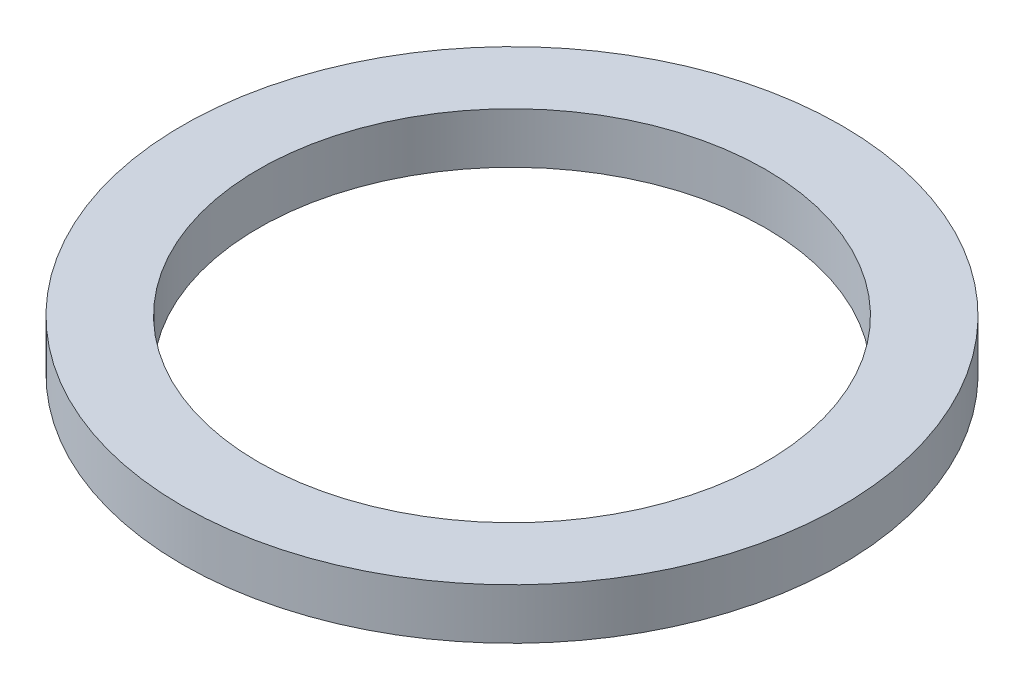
ISO-10303-21;
HEADER;
FILE_DESCRIPTION(('STEP AP214'),'2;1');
FILE_NAME('part.step','',(''),(''),'','','');
FILE_SCHEMA(('AUTOMOTIVE_DESIGN { 1 0 10303 214 1 1 1 1 }'));
ENDSEC;
DATA;
#1=APPLICATION_CONTEXT('core data for automotive mechanical design processes');
#2=APPLICATION_PROTOCOL_DEFINITION('international standard','automotive_design',2000,#1);
#3=PRODUCT_CONTEXT('',#1,'mechanical');
#4=PRODUCT('Part','Part','',(#3));
#5=PRODUCT_RELATED_PRODUCT_CATEGORY('part','',(#4));
#6=PRODUCT_DEFINITION_FORMATION('','',#4);
#7=PRODUCT_DEFINITION_CONTEXT('part definition',#1,'design');
#8=PRODUCT_DEFINITION('design','',#6,#7);
#9=PRODUCT_DEFINITION_SHAPE('','',#8);
#10=(LENGTH_UNIT() NAMED_UNIT(*) SI_UNIT(.MILLI.,.METRE.));
#11=(NAMED_UNIT(*) PLANE_ANGLE_UNIT() SI_UNIT($,.RADIAN.));
#12=(NAMED_UNIT(*) SI_UNIT($,.STERADIAN.) SOLID_ANGLE_UNIT());
#13=UNCERTAINTY_MEASURE_WITH_UNIT(LENGTH_MEASURE(1.E-05),#10,'distance_accuracy_value','');
#14=(GEOMETRIC_REPRESENTATION_CONTEXT(3) GLOBAL_UNCERTAINTY_ASSIGNED_CONTEXT((#13)) GLOBAL_UNIT_ASSIGNED_CONTEXT((#10,
#11,#12)) REPRESENTATION_CONTEXT('',''));
#15=CARTESIAN_POINT('',(0.,0.,0.));
#16=DIRECTION('',(0.,0.,1.));
#17=DIRECTION('',(1.,0.,0.));
#18=AXIS2_PLACEMENT_3D('',#15,#16,#17);
#19=CARTESIAN_POINT('',(0.,0.500000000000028,0.));
#20=DIRECTION('',(0.,1.,0.));
#21=DIRECTION('',(0.,0.,1.));
#22=AXIS2_PLACEMENT_3D('',#19,#20,#21);
#23=PLANE('',#22);
#24=CARTESIAN_POINT('',(0.,0.500000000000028,0.));
#25=DIRECTION('',(0.,1.,0.));
#26=DIRECTION('',(0.,0.,1.));
#27=AXIS2_PLACEMENT_3D('',#24,#25,#26);
#28=CIRCLE('',#27,6.5);
#29=CARTESIAN_POINT('',(0.,0.500000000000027,6.50000000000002));
#30=VERTEX_POINT('',#29);
#31=EDGE_CURVE('E10',#30,#30,#28,.T.);
#32=ORIENTED_EDGE('',*,*,#31,.T.);
#33=EDGE_LOOP('',(#32));
#34=FACE_BOUND('',#33,.T.);
#35=CARTESIAN_POINT('',(0.,0.500000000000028,0.));
#36=DIRECTION('',(0.,1.,0.));
#37=DIRECTION('',(0.,0.,1.));
#38=AXIS2_PLACEMENT_3D('',#35,#36,#37);
#39=CIRCLE('',#38,5.);
#40=CARTESIAN_POINT('',(0.,0.500000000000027,5.00000000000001));
#41=VERTEX_POINT('',#40);
#42=EDGE_CURVE('E37',#41,#41,#39,.T.);
#43=ORIENTED_EDGE('',*,*,#42,.F.);
#44=EDGE_LOOP('',(#43));
#45=FACE_BOUND('',#44,.T.);
#46=ADVANCED_FACE('F26',(#34,#45),#23,.T.);
#47=CARTESIAN_POINT('',(0.,-0.499999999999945,0.));
#48=DIRECTION('',(0.,1.,0.));
#49=DIRECTION('',(0.,0.,1.));
#50=AXIS2_PLACEMENT_3D('',#47,#48,#49);
#51=PLANE('',#50);
#52=CARTESIAN_POINT('',(0.,-0.499999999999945,0.));
#53=DIRECTION('',(0.,1.,0.));
#54=DIRECTION('',(0.,0.,1.));
#55=AXIS2_PLACEMENT_3D('',#52,#53,#54);
#56=CIRCLE('',#55,6.5);
#57=CARTESIAN_POINT('',(0.,-0.499999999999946,6.50000000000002));
#58=VERTEX_POINT('',#57);
#59=EDGE_CURVE('E33',#58,#58,#56,.T.);
#60=ORIENTED_EDGE('',*,*,#59,.F.);
#61=EDGE_LOOP('',(#60));
#62=FACE_BOUND('',#61,.T.);
#63=CARTESIAN_POINT('',(0.,-0.499999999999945,0.));
#64=DIRECTION('',(0.,1.,0.));
#65=DIRECTION('',(0.,0.,1.));
#66=AXIS2_PLACEMENT_3D('',#63,#64,#65);
#67=CIRCLE('',#66,5.);
#68=CARTESIAN_POINT('',(0.,-0.499999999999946,5.00000000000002));
#69=VERTEX_POINT('',#68);
#70=EDGE_CURVE('E41',#69,#69,#67,.T.);
#71=ORIENTED_EDGE('',*,*,#70,.T.);
#72=EDGE_LOOP('',(#71));
#73=FACE_BOUND('',#72,.T.);
#74=ADVANCED_FACE('F47',(#62,#73),#51,.F.);
#75=CARTESIAN_POINT('',(0.,0.500000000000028,0.));
#76=DIRECTION('',(0.,-1.,0.));
#77=DIRECTION('',(0.,0.,-1.));
#78=AXIS2_PLACEMENT_3D('',#75,#76,#77);
#79=CYLINDRICAL_SURFACE('',#78,6.5);
#80=ORIENTED_EDGE('',*,*,#31,.F.);
#81=EDGE_LOOP('',(#80));
#82=FACE_BOUND('',#81,.T.);
#83=ORIENTED_EDGE('',*,*,#59,.T.);
#84=EDGE_LOOP('',(#83));
#85=FACE_BOUND('',#84,.T.);
#86=ADVANCED_FACE('F28',(#82,#85),#79,.T.);
#87=CARTESIAN_POINT('',(0.,0.500000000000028,0.));
#88=DIRECTION('',(0.,-1.,0.));
#89=DIRECTION('',(0.,0.,-1.));
#90=AXIS2_PLACEMENT_3D('',#87,#88,#89);
#91=CYLINDRICAL_SURFACE('',#90,5.);
#92=ORIENTED_EDGE('',*,*,#42,.T.);
#93=EDGE_LOOP('',(#92));
#94=FACE_BOUND('',#93,.T.);
#95=ORIENTED_EDGE('',*,*,#70,.F.);
#96=EDGE_LOOP('',(#95));
#97=FACE_BOUND('',#96,.T.);
#98=ADVANCED_FACE('F49',(#94,#97),#91,.F.);
#99=CLOSED_SHELL('',(#46,#74,#86,#98));
#100=MANIFOLD_SOLID_BREP('B2',#99);
#101=ADVANCED_BREP_SHAPE_REPRESENTATION('',(#18,#100),#14);
#102=SHAPE_DEFINITION_REPRESENTATION(#9,#101);
ENDSEC;
END-ISO-10303-21;
